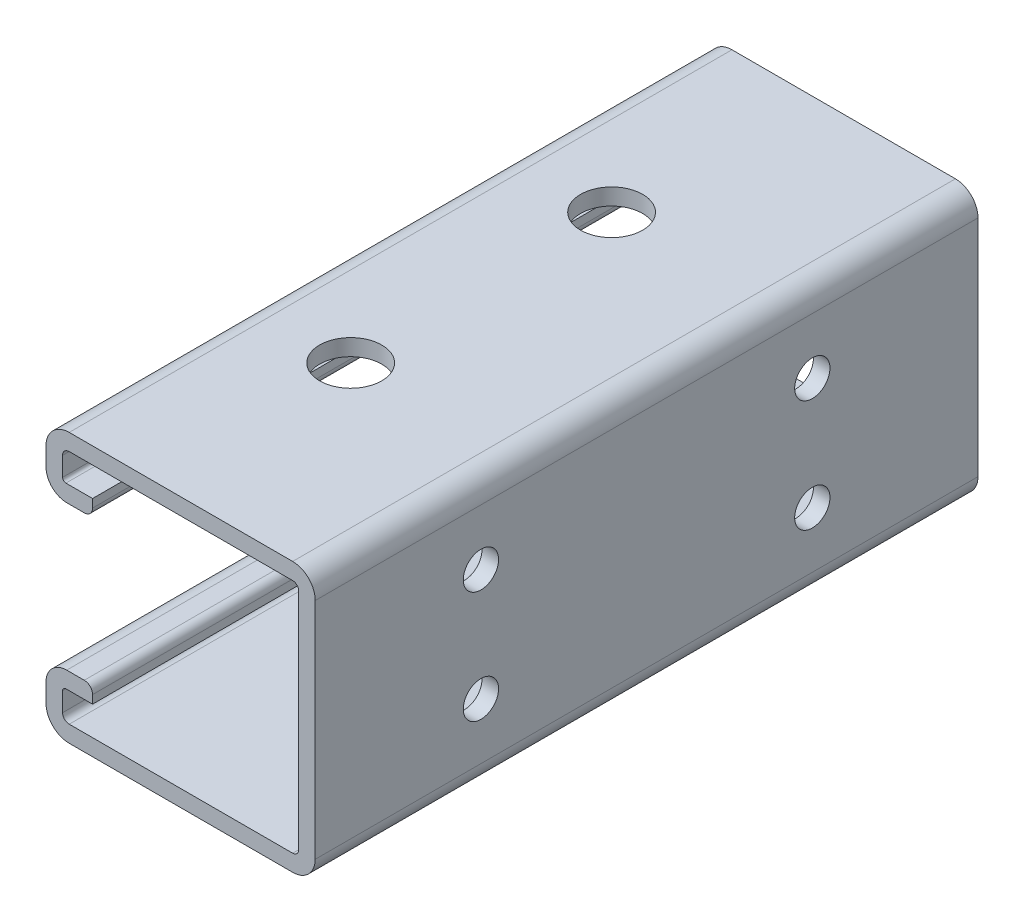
from build123d import *

# Parameters (mm, degrees)
BOSS_EXTRUDE1_DEPTH             = 50.8
BOSS_EXTRUDE1_DEPTH_BACK        = 50.8
SKETCH7_R                       = 4.7625
CUT_EXTRUDE1_DEPTH              = 45.72
TAP_DRILL_FOR_1_4_28_TAP2_D     = 5.4102
TAP_DRILL_FOR_1_4_28_TAP2_DEPTH = 2.54
TAP_DRILL_FOR_1_4_28_TAP2_TIP   = 1.625388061


with BuildPart() as part:
    # Sketch4 → Boss-Extrude1 (new, two sides: drawn at the far end of the back side and taken through both)
    with BuildSketch(Plane.XY.offset(-BOSS_EXTRUDE1_DEPTH_BACK)):
        with BuildLine():
            Line((-17.0815, -20.6375), (17.17675, -20.6375))
            ThreePointArc((17.17675, -20.6375), (19.623869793, -19.623869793), (20.6375, -17.17675))
            Line((20.6375, -17.17675), (20.6375, 17.17675))
            ThreePointArc((20.6375, 17.17675), (19.623869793, 19.623869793), (17.17675, 20.6375))
            Line((17.17675, 20.6375), (-17.0815, 20.6375))
            ThreePointArc((-17.0815, 20.6375), (-19.595971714, 19.595971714), (-20.6375, 17.0815))
            Line((-20.6375, 17.0815), (-20.6375, 14.2875))
            ThreePointArc((-20.6375, 14.2875), (-19.70756403, 12.04243597), (-17.4625, 11.1125))
            Line((-17.4625, 11.1125), (-14.7701, 11.1125))
            ThreePointArc((-14.7701, 11.1125), (-13.872074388, 11.484474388), (-13.5001, 12.3825))
            Line((-13.5001, 12.3825), (-13.5001, 13.6525))
            Line((-13.5001, 13.6525), (-17.5895, 13.6525))
            ThreePointArc((-17.5895, 13.6525), (-17.948710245, 13.801289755), (-18.0975, 14.1605))
            Line((-18.0975, 14.1605), (-18.0975, 17.0815))
            ThreePointArc((-18.0975, 17.0815), (-17.79992049, 17.79992049), (-17.0815, 18.0975))
            Line((-17.0815, 18.0975), (17.17675, 18.0975))
            ThreePointArc((17.17675, 18.0975), (17.827818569, 17.827818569), (18.0975, 17.17675))
            Line((18.0975, 17.17675), (18.0975, -17.17675))
            ThreePointArc((18.0975, -17.17675), (17.827818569, -17.827818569), (17.17675, -18.0975))
            Line((17.17675, -18.0975), (-17.0815, -18.0975))
            ThreePointArc((-17.0815, -18.0975), (-17.79992049, -17.79992049), (-18.0975, -17.0815))
            Line((-18.0975, -17.0815), (-18.0975, -14.1605))
            ThreePointArc((-18.0975, -14.1605), (-17.948710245, -13.801289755), (-17.5895, -13.6525))
            Line((-17.5895, -13.6525), (-13.5001, -13.6525))
            Line((-13.5001, -13.6525), (-13.5001, -12.3825))
            ThreePointArc((-13.5001, -12.3825), (-13.872074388, -11.484474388), (-14.7701, -11.1125))
            Line((-14.7701, -11.1125), (-17.4625, -11.1125))
            ThreePointArc((-17.4625, -11.1125), (-19.70756403, -12.04243597), (-20.6375, -14.2875))
            Line((-20.6375, -14.2875), (-20.6375, -17.0815))
            ThreePointArc((-20.6375, -17.0815), (-19.595971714, -19.595971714), (-17.0815, -20.6375))
        make_face()
    extrude(amount=BOSS_EXTRUDE1_DEPTH + BOSS_EXTRUDE1_DEPTH_BACK)

    # Sketch7 → Cut-Extrude1 (cut)
    with BuildSketch(Plane(origin=(0, 20.6375, 0), x_dir=(1, 0, 0), z_dir=(0, 1, 0))):
        with Locations(Location((-4.73075, -20, 0), (0, 0, 180))):
            Circle(SKETCH7_R)
        with Locations(Location((-4.73075, 20, 0), (0, 0, 180))):
            Circle(SKETCH7_R)
    extrude(amount=-CUT_EXTRUDE1_DEPTH, mode=Mode.SUBTRACT)

    # Tap Drill for 1_4-28 Tap2
    with Locations(Plane(origin=(20.6375, 0, 0), x_dir=(0, 0, -1), z_dir=(1, 0, 0))):
        with Locations((-25.4, 8.588375), (25.4, 8.588375), (25.4, -8.588375), (-25.4, -8.588375)):
            Hole(TAP_DRILL_FOR_1_4_28_TAP2_D / 2, depth=TAP_DRILL_FOR_1_4_28_TAP2_DEPTH)
            with Locations((0, 0, -(TAP_DRILL_FOR_1_4_28_TAP2_DEPTH + TAP_DRILL_FOR_1_4_28_TAP2_TIP / 2))):  # 118° drill point
                Cone(0, TAP_DRILL_FOR_1_4_28_TAP2_D / 2, TAP_DRILL_FOR_1_4_28_TAP2_TIP, mode=Mode.SUBTRACT)


solid = part.part
